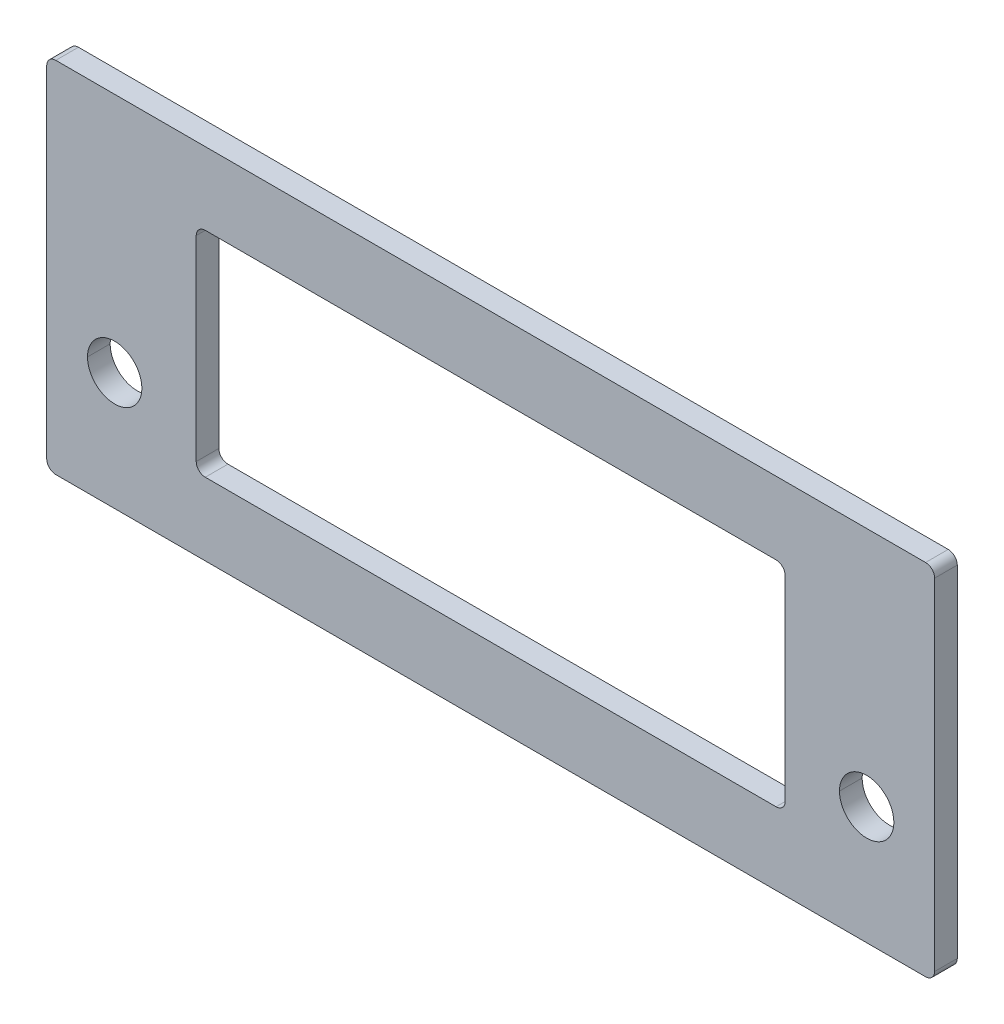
ISO-10303-21;
HEADER;
FILE_DESCRIPTION(('STEP AP214'),'2;1');
FILE_NAME('part.step','',(''),(''),'','','');
FILE_SCHEMA(('AUTOMOTIVE_DESIGN { 1 0 10303 214 1 1 1 1 }'));
ENDSEC;
DATA;
#1=APPLICATION_CONTEXT('core data for automotive mechanical design processes');
#2=APPLICATION_PROTOCOL_DEFINITION('international standard','automotive_design',2000,#1);
#3=PRODUCT_CONTEXT('',#1,'mechanical');
#4=PRODUCT('Part','Part','',(#3));
#5=PRODUCT_RELATED_PRODUCT_CATEGORY('part','',(#4));
#6=PRODUCT_DEFINITION_FORMATION('','',#4);
#7=PRODUCT_DEFINITION_CONTEXT('part definition',#1,'design');
#8=PRODUCT_DEFINITION('design','',#6,#7);
#9=PRODUCT_DEFINITION_SHAPE('','',#8);
#10=(LENGTH_UNIT() NAMED_UNIT(*) SI_UNIT(.MILLI.,.METRE.));
#11=(NAMED_UNIT(*) PLANE_ANGLE_UNIT() SI_UNIT($,.RADIAN.));
#12=(NAMED_UNIT(*) SI_UNIT($,.STERADIAN.) SOLID_ANGLE_UNIT());
#13=UNCERTAINTY_MEASURE_WITH_UNIT(LENGTH_MEASURE(1.E-05),#10,'distance_accuracy_value','');
#14=(GEOMETRIC_REPRESENTATION_CONTEXT(3) GLOBAL_UNCERTAINTY_ASSIGNED_CONTEXT((#13)) GLOBAL_UNIT_ASSIGNED_CONTEXT((#10,
#11,#12)) REPRESENTATION_CONTEXT('',''));
#15=CARTESIAN_POINT('',(0.,0.,0.));
#16=DIRECTION('',(0.,0.,1.));
#17=DIRECTION('',(1.,0.,0.));
#18=AXIS2_PLACEMENT_3D('',#15,#16,#17);
#19=CARTESIAN_POINT('',(48.,18.85,-8.5));
#20=DIRECTION('',(0.,0.,-1.));
#21=DIRECTION('',(-1.,0.,0.));
#22=AXIS2_PLACEMENT_3D('',#19,#20,#21);
#23=CYLINDRICAL_SURFACE('',#22,1.);
#24=CARTESIAN_POINT('',(48.,18.85,-8.5));
#25=DIRECTION('',(0.,0.,1.));
#26=DIRECTION('',(-1.,0.,0.));
#27=AXIS2_PLACEMENT_3D('',#24,#25,#26);
#28=CIRCLE('',#27,1.);
#29=CARTESIAN_POINT('',(49.,18.85,-8.5));
#30=VERTEX_POINT('',#29);
#31=CARTESIAN_POINT('',(48.,19.85,-8.5));
#32=VERTEX_POINT('',#31);
#33=EDGE_CURVE('E251',#30,#32,#28,.T.);
#34=ORIENTED_EDGE('',*,*,#33,.F.);
#35=DIRECTION('',(0.,0.,1.));
#36=VECTOR('',#35,1.);
#37=CARTESIAN_POINT('',(49.,18.85,-8.5));
#38=LINE('',#37,#36);
#39=CARTESIAN_POINT('',(49.,18.85,-11.));
#40=VERTEX_POINT('',#39);
#41=EDGE_CURVE('E398',#40,#30,#38,.T.);
#42=ORIENTED_EDGE('',*,*,#41,.F.);
#43=CARTESIAN_POINT('',(48.,18.85,-11.));
#44=DIRECTION('',(0.,0.,-1.));
#45=DIRECTION('',(-1.,0.,0.));
#46=AXIS2_PLACEMENT_3D('',#43,#44,#45);
#47=CIRCLE('',#46,1.);
#48=CARTESIAN_POINT('',(48.,19.85,-11.));
#49=VERTEX_POINT('',#48);
#50=EDGE_CURVE('E343',#49,#40,#47,.T.);
#51=ORIENTED_EDGE('',*,*,#50,.F.);
#52=DIRECTION('',(0.,0.,-1.));
#53=VECTOR('',#52,1.);
#54=CARTESIAN_POINT('',(48.,19.85,-8.5));
#55=LINE('',#54,#53);
#56=EDGE_CURVE('E404',#32,#49,#55,.T.);
#57=ORIENTED_EDGE('',*,*,#56,.F.);
#58=EDGE_LOOP('',(#34,#42,#51,#57));
#59=FACE_BOUND('',#58,.T.);
#60=ADVANCED_FACE('F15',(#59),#23,.T.);
#61=CARTESIAN_POINT('',(48.,-18.75,-8.5));
#62=DIRECTION('',(0.,0.,-1.));
#63=DIRECTION('',(-1.,0.,0.));
#64=AXIS2_PLACEMENT_3D('',#61,#62,#63);
#65=CYLINDRICAL_SURFACE('',#64,1.);
#66=CARTESIAN_POINT('',(48.,-18.75,-8.5));
#67=DIRECTION('',(0.,0.,1.));
#68=DIRECTION('',(-1.,0.,0.));
#69=AXIS2_PLACEMENT_3D('',#66,#67,#68);
#70=CIRCLE('',#69,1.);
#71=CARTESIAN_POINT('',(48.,-19.75,-8.5));
#72=VERTEX_POINT('',#71);
#73=CARTESIAN_POINT('',(49.,-18.75,-8.5));
#74=VERTEX_POINT('',#73);
#75=EDGE_CURVE('E227',#72,#74,#70,.T.);
#76=ORIENTED_EDGE('',*,*,#75,.F.);
#77=DIRECTION('',(0.,0.,1.));
#78=VECTOR('',#77,1.);
#79=CARTESIAN_POINT('',(48.,-19.75,-8.5));
#80=LINE('',#79,#78);
#81=CARTESIAN_POINT('',(48.,-19.75,-11.));
#82=VERTEX_POINT('',#81);
#83=EDGE_CURVE('E392',#82,#72,#80,.T.);
#84=ORIENTED_EDGE('',*,*,#83,.F.);
#85=CARTESIAN_POINT('',(48.,-18.75,-11.));
#86=DIRECTION('',(0.,0.,-1.));
#87=DIRECTION('',(-1.,0.,0.));
#88=AXIS2_PLACEMENT_3D('',#85,#86,#87);
#89=CIRCLE('',#88,1.);
#90=CARTESIAN_POINT('',(49.,-18.75,-11.));
#91=VERTEX_POINT('',#90);
#92=EDGE_CURVE('E240',#91,#82,#89,.T.);
#93=ORIENTED_EDGE('',*,*,#92,.F.);
#94=DIRECTION('',(0.,0.,-1.));
#95=VECTOR('',#94,1.);
#96=CARTESIAN_POINT('',(49.,-18.75,-8.5));
#97=LINE('',#96,#95);
#98=EDGE_CURVE('E395',#74,#91,#97,.T.);
#99=ORIENTED_EDGE('',*,*,#98,.F.);
#100=EDGE_LOOP('',(#76,#84,#93,#99));
#101=FACE_BOUND('',#100,.T.);
#102=ADVANCED_FACE('F465',(#101),#65,.T.);
#103=CARTESIAN_POINT('',(-48.,-18.75,-8.5));
#104=DIRECTION('',(0.,0.,-1.));
#105=DIRECTION('',(-1.,0.,0.));
#106=AXIS2_PLACEMENT_3D('',#103,#104,#105);
#107=CYLINDRICAL_SURFACE('',#106,1.);
#108=CARTESIAN_POINT('',(-48.,-18.75,-8.5));
#109=DIRECTION('',(0.,0.,1.));
#110=DIRECTION('',(-1.,0.,0.));
#111=AXIS2_PLACEMENT_3D('',#108,#109,#110);
#112=CIRCLE('',#111,1.);
#113=CARTESIAN_POINT('',(-49.,-18.75,-8.5));
#114=VERTEX_POINT('',#113);
#115=CARTESIAN_POINT('',(-48.,-19.75,-8.5));
#116=VERTEX_POINT('',#115);
#117=EDGE_CURVE('E228',#114,#116,#112,.T.);
#118=ORIENTED_EDGE('',*,*,#117,.F.);
#119=DIRECTION('',(0.,0.,1.));
#120=VECTOR('',#119,1.);
#121=CARTESIAN_POINT('',(-49.,-18.75,-8.5));
#122=LINE('',#121,#120);
#123=CARTESIAN_POINT('',(-49.,-18.75,-11.));
#124=VERTEX_POINT('',#123);
#125=EDGE_CURVE('E386',#124,#114,#122,.T.);
#126=ORIENTED_EDGE('',*,*,#125,.F.);
#127=CARTESIAN_POINT('',(-48.,-18.75,-11.));
#128=DIRECTION('',(0.,0.,-1.));
#129=DIRECTION('',(-1.,0.,0.));
#130=AXIS2_PLACEMENT_3D('',#127,#128,#129);
#131=CIRCLE('',#130,1.);
#132=CARTESIAN_POINT('',(-48.,-19.75,-11.));
#133=VERTEX_POINT('',#132);
#134=EDGE_CURVE('E293',#133,#124,#131,.T.);
#135=ORIENTED_EDGE('',*,*,#134,.F.);
#136=DIRECTION('',(0.,0.,-1.));
#137=VECTOR('',#136,1.);
#138=CARTESIAN_POINT('',(-48.,-19.75,-8.5));
#139=LINE('',#138,#137);
#140=EDGE_CURVE('E389',#116,#133,#139,.T.);
#141=ORIENTED_EDGE('',*,*,#140,.F.);
#142=EDGE_LOOP('',(#118,#126,#135,#141));
#143=FACE_BOUND('',#142,.T.);
#144=ADVANCED_FACE('F470',(#143),#107,.T.);
#145=CARTESIAN_POINT('',(-48.,18.85,-8.5));
#146=DIRECTION('',(0.,0.,-1.));
#147=DIRECTION('',(-1.,0.,0.));
#148=AXIS2_PLACEMENT_3D('',#145,#146,#147);
#149=CYLINDRICAL_SURFACE('',#148,1.);
#150=CARTESIAN_POINT('',(-48.,18.85,-8.5));
#151=DIRECTION('',(0.,0.,1.));
#152=DIRECTION('',(-1.,0.,0.));
#153=AXIS2_PLACEMENT_3D('',#150,#151,#152);
#154=CIRCLE('',#153,1.);
#155=CARTESIAN_POINT('',(-48.,19.85,-8.5));
#156=VERTEX_POINT('',#155);
#157=CARTESIAN_POINT('',(-49.,18.85,-8.5));
#158=VERTEX_POINT('',#157);
#159=EDGE_CURVE('E234',#156,#158,#154,.T.);
#160=ORIENTED_EDGE('',*,*,#159,.F.);
#161=DIRECTION('',(0.,0.,1.));
#162=VECTOR('',#161,1.);
#163=CARTESIAN_POINT('',(-48.,19.85,-8.5));
#164=LINE('',#163,#162);
#165=CARTESIAN_POINT('',(-48.,19.85,-11.));
#166=VERTEX_POINT('',#165);
#167=EDGE_CURVE('E401',#166,#156,#164,.T.);
#168=ORIENTED_EDGE('',*,*,#167,.F.);
#169=CARTESIAN_POINT('',(-48.,18.85,-11.));
#170=DIRECTION('',(0.,0.,-1.));
#171=DIRECTION('',(-1.,0.,0.));
#172=AXIS2_PLACEMENT_3D('',#169,#170,#171);
#173=CIRCLE('',#172,1.);
#174=CARTESIAN_POINT('',(-49.,18.85,-11.));
#175=VERTEX_POINT('',#174);
#176=EDGE_CURVE('E335',#175,#166,#173,.T.);
#177=ORIENTED_EDGE('',*,*,#176,.F.);
#178=DIRECTION('',(0.,0.,-1.));
#179=VECTOR('',#178,1.);
#180=CARTESIAN_POINT('',(-49.,18.85,-8.5));
#181=LINE('',#180,#179);
#182=EDGE_CURVE('E383',#158,#175,#181,.T.);
#183=ORIENTED_EDGE('',*,*,#182,.F.);
#184=EDGE_LOOP('',(#160,#168,#177,#183));
#185=FACE_BOUND('',#184,.T.);
#186=ADVANCED_FACE('F490',(#185),#149,.T.);
#187=CARTESIAN_POINT('',(-31.5,-10.75,60.6517172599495));
#188=DIRECTION('',(0.,0.,1.));
#189=DIRECTION('',(1.,0.,0.));
#190=AXIS2_PLACEMENT_3D('',#187,#188,#189);
#191=CYLINDRICAL_SURFACE('',#190,1.);
#192=CARTESIAN_POINT('',(-31.5,-10.75,-8.5));
#193=DIRECTION('',(0.,0.,-1.));
#194=DIRECTION('',(-1.,0.,0.));
#195=AXIS2_PLACEMENT_3D('',#192,#193,#194);
#196=CIRCLE('',#195,1.);
#197=CARTESIAN_POINT('',(-31.5,-11.75,-8.5));
#198=VERTEX_POINT('',#197);
#199=CARTESIAN_POINT('',(-32.5,-10.75,-8.5));
#200=VERTEX_POINT('',#199);
#201=EDGE_CURVE('E321',#198,#200,#196,.T.);
#202=ORIENTED_EDGE('',*,*,#201,.F.);
#203=DIRECTION('',(0.,0.,1.));
#204=VECTOR('',#203,1.);
#205=CARTESIAN_POINT('',(-31.5,-11.75,-8.5));
#206=LINE('',#205,#204);
#207=CARTESIAN_POINT('',(-31.5,-11.75,-11.));
#208=VERTEX_POINT('',#207);
#209=EDGE_CURVE('E329',#208,#198,#206,.T.);
#210=ORIENTED_EDGE('',*,*,#209,.F.);
#211=CARTESIAN_POINT('',(-31.5,-10.75,-11.));
#212=DIRECTION('',(0.,0.,1.));
#213=DIRECTION('',(-1.,0.,0.));
#214=AXIS2_PLACEMENT_3D('',#211,#212,#213);
#215=CIRCLE('',#214,1.);
#216=CARTESIAN_POINT('',(-32.5,-10.75,-11.));
#217=VERTEX_POINT('',#216);
#218=EDGE_CURVE('E377',#217,#208,#215,.T.);
#219=ORIENTED_EDGE('',*,*,#218,.F.);
#220=DIRECTION('',(0.,0.,-1.));
#221=VECTOR('',#220,1.);
#222=CARTESIAN_POINT('',(-32.5,-10.75,-11.));
#223=LINE('',#222,#221);
#224=EDGE_CURVE('E10',#200,#217,#223,.T.);
#225=ORIENTED_EDGE('',*,*,#224,.F.);
#226=EDGE_LOOP('',(#202,#210,#219,#225));
#227=FACE_BOUND('',#226,.T.);
#228=ADVANCED_FACE('F432',(#227),#191,.F.);
#229=CARTESIAN_POINT('',(-31.5,10.85,60.6517172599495));
#230=DIRECTION('',(0.,0.,1.));
#231=DIRECTION('',(1.,0.,0.));
#232=AXIS2_PLACEMENT_3D('',#229,#230,#231);
#233=CYLINDRICAL_SURFACE('',#232,1.);
#234=CARTESIAN_POINT('',(-31.5,10.85,-8.5));
#235=DIRECTION('',(0.,0.,-1.));
#236=DIRECTION('',(-1.,0.,0.));
#237=AXIS2_PLACEMENT_3D('',#234,#235,#236);
#238=CIRCLE('',#237,1.);
#239=CARTESIAN_POINT('',(-32.5,10.85,-8.5));
#240=VERTEX_POINT('',#239);
#241=CARTESIAN_POINT('',(-31.5,11.85,-8.5));
#242=VERTEX_POINT('',#241);
#243=EDGE_CURVE('E297',#240,#242,#238,.T.);
#244=ORIENTED_EDGE('',*,*,#243,.F.);
#245=DIRECTION('',(0.,0.,1.));
#246=VECTOR('',#245,1.);
#247=CARTESIAN_POINT('',(-32.5,10.85,-8.5));
#248=LINE('',#247,#246);
#249=CARTESIAN_POINT('',(-32.5,10.85,-11.));
#250=VERTEX_POINT('',#249);
#251=EDGE_CURVE('E18',#250,#240,#248,.T.);
#252=ORIENTED_EDGE('',*,*,#251,.F.);
#253=CARTESIAN_POINT('',(-31.5,10.85,-11.));
#254=DIRECTION('',(0.,0.,1.));
#255=DIRECTION('',(-1.,0.,0.));
#256=AXIS2_PLACEMENT_3D('',#253,#254,#255);
#257=CIRCLE('',#256,1.);
#258=CARTESIAN_POINT('',(-31.5,11.85,-11.));
#259=VERTEX_POINT('',#258);
#260=EDGE_CURVE('E273',#259,#250,#257,.T.);
#261=ORIENTED_EDGE('',*,*,#260,.F.);
#262=DIRECTION('',(0.,0.,-1.));
#263=VECTOR('',#262,1.);
#264=CARTESIAN_POINT('',(-31.5,11.85,-11.));
#265=LINE('',#264,#263);
#266=EDGE_CURVE('E410',#242,#259,#265,.T.);
#267=ORIENTED_EDGE('',*,*,#266,.F.);
#268=EDGE_LOOP('',(#244,#252,#261,#267));
#269=FACE_BOUND('',#268,.T.);
#270=ADVANCED_FACE('F427',(#269),#233,.F.);
#271=CARTESIAN_POINT('',(31.5,10.85,60.6517172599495));
#272=DIRECTION('',(0.,0.,1.));
#273=DIRECTION('',(1.,0.,0.));
#274=AXIS2_PLACEMENT_3D('',#271,#272,#273);
#275=CYLINDRICAL_SURFACE('',#274,1.);
#276=CARTESIAN_POINT('',(31.5,10.85,-8.5));
#277=DIRECTION('',(0.,0.,-1.));
#278=DIRECTION('',(-1.,0.,0.));
#279=AXIS2_PLACEMENT_3D('',#276,#277,#278);
#280=CIRCLE('',#279,1.);
#281=CARTESIAN_POINT('',(31.5,11.85,-8.5));
#282=VERTEX_POINT('',#281);
#283=CARTESIAN_POINT('',(32.5,10.85,-8.5));
#284=VERTEX_POINT('',#283);
#285=EDGE_CURVE('E305',#282,#284,#280,.T.);
#286=ORIENTED_EDGE('',*,*,#285,.F.);
#287=DIRECTION('',(0.,0.,1.));
#288=VECTOR('',#287,1.);
#289=CARTESIAN_POINT('',(31.5,11.85,-8.5));
#290=LINE('',#289,#288);
#291=CARTESIAN_POINT('',(31.5,11.85,-11.));
#292=VERTEX_POINT('',#291);
#293=EDGE_CURVE('E407',#292,#282,#290,.T.);
#294=ORIENTED_EDGE('',*,*,#293,.F.);
#295=CARTESIAN_POINT('',(31.5,10.85,-11.));
#296=DIRECTION('',(0.,0.,1.));
#297=DIRECTION('',(-1.,0.,0.));
#298=AXIS2_PLACEMENT_3D('',#295,#296,#297);
#299=CIRCLE('',#298,1.);
#300=CARTESIAN_POINT('',(32.5,10.85,-11.));
#301=VERTEX_POINT('',#300);
#302=EDGE_CURVE('E367',#301,#292,#299,.T.);
#303=ORIENTED_EDGE('',*,*,#302,.F.);
#304=DIRECTION('',(0.,0.,-1.));
#305=VECTOR('',#304,1.);
#306=CARTESIAN_POINT('',(32.5,10.85,-11.));
#307=LINE('',#306,#305);
#308=EDGE_CURVE('E330',#284,#301,#307,.T.);
#309=ORIENTED_EDGE('',*,*,#308,.F.);
#310=EDGE_LOOP('',(#286,#294,#303,#309));
#311=FACE_BOUND('',#310,.T.);
#312=ADVANCED_FACE('F443',(#311),#275,.F.);
#313=CARTESIAN_POINT('',(31.5,-10.75,60.6517172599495));
#314=DIRECTION('',(0.,0.,1.));
#315=DIRECTION('',(1.,0.,0.));
#316=AXIS2_PLACEMENT_3D('',#313,#314,#315);
#317=CYLINDRICAL_SURFACE('',#316,1.);
#318=CARTESIAN_POINT('',(31.5,-10.75,-8.5));
#319=DIRECTION('',(0.,0.,-1.));
#320=DIRECTION('',(-1.,0.,0.));
#321=AXIS2_PLACEMENT_3D('',#318,#319,#320);
#322=CIRCLE('',#321,1.);
#323=CARTESIAN_POINT('',(32.5,-10.75,-8.5));
#324=VERTEX_POINT('',#323);
#325=CARTESIAN_POINT('',(31.5,-11.75,-8.5));
#326=VERTEX_POINT('',#325);
#327=EDGE_CURVE('E313',#324,#326,#322,.T.);
#328=ORIENTED_EDGE('',*,*,#327,.F.);
#329=DIRECTION('',(0.,0.,1.));
#330=VECTOR('',#329,1.);
#331=CARTESIAN_POINT('',(32.5,-10.75,-8.5));
#332=LINE('',#331,#330);
#333=CARTESIAN_POINT('',(32.5,-10.75,-11.));
#334=VERTEX_POINT('',#333);
#335=EDGE_CURVE('E413',#334,#324,#332,.T.);
#336=ORIENTED_EDGE('',*,*,#335,.F.);
#337=CARTESIAN_POINT('',(31.5,-10.75,-11.));
#338=DIRECTION('',(0.,0.,1.));
#339=DIRECTION('',(-1.,0.,0.));
#340=AXIS2_PLACEMENT_3D('',#337,#338,#339);
#341=CIRCLE('',#340,1.);
#342=CARTESIAN_POINT('',(31.5,-11.75,-11.));
#343=VERTEX_POINT('',#342);
#344=EDGE_CURVE('E359',#343,#334,#341,.T.);
#345=ORIENTED_EDGE('',*,*,#344,.F.);
#346=DIRECTION('',(0.,0.,-1.));
#347=VECTOR('',#346,1.);
#348=CARTESIAN_POINT('',(31.5,-11.75,-11.));
#349=LINE('',#348,#347);
#350=EDGE_CURVE('E327',#326,#343,#349,.T.);
#351=ORIENTED_EDGE('',*,*,#350,.F.);
#352=EDGE_LOOP('',(#328,#336,#345,#351));
#353=FACE_BOUND('',#352,.T.);
#354=ADVANCED_FACE('F450',(#353),#317,.F.);
#355=CARTESIAN_POINT('',(41.5,-6.75,60.6517172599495));
#356=DIRECTION('',(0.,0.,-1.));
#357=DIRECTION('',(-1.,0.,0.));
#358=AXIS2_PLACEMENT_3D('',#355,#356,#357);
#359=CYLINDRICAL_SURFACE('',#358,3.);
#360=DIRECTION('',(0.,0.,-1.));
#361=VECTOR('',#360,1.);
#362=CARTESIAN_POINT('',(44.5,-6.75,60.6517172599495));
#363=LINE('',#362,#361);
#364=CARTESIAN_POINT('',(44.5,-6.75,-8.5));
#365=VERTEX_POINT('',#364);
#366=CARTESIAN_POINT('',(44.5,-6.75,-11.));
#367=VERTEX_POINT('',#366);
#368=EDGE_CURVE('E209',#365,#367,#363,.T.);
#369=ORIENTED_EDGE('',*,*,#368,.F.);
#370=CARTESIAN_POINT('',(41.5,-6.75,-8.5));
#371=DIRECTION('',(0.,0.,-1.));
#372=DIRECTION('',(-1.,0.,0.));
#373=AXIS2_PLACEMENT_3D('',#370,#371,#372);
#374=CIRCLE('',#373,3.);
#375=CARTESIAN_POINT('',(38.5,-6.75,-8.5));
#376=VERTEX_POINT('',#375);
#377=EDGE_CURVE('E195',#376,#365,#374,.T.);
#378=ORIENTED_EDGE('',*,*,#377,.F.);
#379=DIRECTION('',(0.,0.,-1.));
#380=VECTOR('',#379,1.);
#381=CARTESIAN_POINT('',(38.5,-6.75,60.6517172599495));
#382=LINE('',#381,#380);
#383=CARTESIAN_POINT('',(38.5,-6.75,-11.));
#384=VERTEX_POINT('',#383);
#385=EDGE_CURVE('E219',#376,#384,#382,.T.);
#386=ORIENTED_EDGE('',*,*,#385,.T.);
#387=CARTESIAN_POINT('',(41.5,-6.75,-11.));
#388=DIRECTION('',(0.,0.,1.));
#389=DIRECTION('',(1.,0.,0.));
#390=AXIS2_PLACEMENT_3D('',#387,#388,#389);
#391=CIRCLE('',#390,3.);
#392=EDGE_CURVE('E211',#367,#384,#391,.T.);
#393=ORIENTED_EDGE('',*,*,#392,.F.);
#394=EDGE_LOOP('',(#369,#378,#386,#393));
#395=FACE_BOUND('',#394,.T.);
#396=ADVANCED_FACE('F210',(#395),#359,.F.);
#397=CARTESIAN_POINT('',(-41.5,-6.75,60.6517172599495));
#398=DIRECTION('',(0.,0.,-1.));
#399=DIRECTION('',(-1.,0.,0.));
#400=AXIS2_PLACEMENT_3D('',#397,#398,#399);
#401=CYLINDRICAL_SURFACE('',#400,3.);
#402=DIRECTION('',(0.,0.,-1.));
#403=VECTOR('',#402,1.);
#404=CARTESIAN_POINT('',(-38.5,-6.75,60.6517172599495));
#405=LINE('',#404,#403);
#406=CARTESIAN_POINT('',(-38.5,-6.75,-8.5));
#407=VERTEX_POINT('',#406);
#408=CARTESIAN_POINT('',(-38.5,-6.75,-11.));
#409=VERTEX_POINT('',#408);
#410=EDGE_CURVE('E261',#407,#409,#405,.T.);
#411=ORIENTED_EDGE('',*,*,#410,.F.);
#412=CARTESIAN_POINT('',(-41.5,-6.75,-8.5));
#413=DIRECTION('',(0.,0.,-1.));
#414=DIRECTION('',(-1.,0.,0.));
#415=AXIS2_PLACEMENT_3D('',#412,#413,#414);
#416=CIRCLE('',#415,3.);
#417=CARTESIAN_POINT('',(-44.5,-6.75,-8.5));
#418=VERTEX_POINT('',#417);
#419=EDGE_CURVE('E206',#418,#407,#416,.T.);
#420=ORIENTED_EDGE('',*,*,#419,.F.);
#421=DIRECTION('',(0.,0.,-1.));
#422=VECTOR('',#421,1.);
#423=CARTESIAN_POINT('',(-44.5,-6.75,60.6517172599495));
#424=LINE('',#423,#422);
#425=CARTESIAN_POINT('',(-44.5,-6.75,-11.));
#426=VERTEX_POINT('',#425);
#427=EDGE_CURVE('E269',#418,#426,#424,.T.);
#428=ORIENTED_EDGE('',*,*,#427,.T.);
#429=CARTESIAN_POINT('',(-41.5,-6.75,-11.));
#430=DIRECTION('',(0.,0.,1.));
#431=DIRECTION('',(1.,0.,0.));
#432=AXIS2_PLACEMENT_3D('',#429,#430,#431);
#433=CIRCLE('',#432,3.);
#434=EDGE_CURVE('E289',#409,#426,#433,.T.);
#435=ORIENTED_EDGE('',*,*,#434,.F.);
#436=EDGE_LOOP('',(#411,#420,#428,#435));
#437=FACE_BOUND('',#436,.T.);
#438=ADVANCED_FACE('F460',(#437),#401,.F.);
#439=CARTESIAN_POINT('',(-32.5,-11.75,60.6517172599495));
#440=DIRECTION('',(1.,0.,0.));
#441=DIRECTION('',(0.,1.,0.));
#442=AXIS2_PLACEMENT_3D('',#439,#440,#441);
#443=PLANE('',#442);
#444=DIRECTION('',(0.,-1.,0.));
#445=VECTOR('',#444,1.);
#446=CARTESIAN_POINT('',(-32.5,-11.75,-11.));
#447=LINE('',#446,#445);
#448=EDGE_CURVE('E277',#250,#217,#447,.T.);
#449=ORIENTED_EDGE('',*,*,#448,.F.);
#450=ORIENTED_EDGE('',*,*,#251,.T.);
#451=DIRECTION('',(0.,1.,0.));
#452=VECTOR('',#451,1.);
#453=CARTESIAN_POINT('',(-32.5,-11.75,-8.5));
#454=LINE('',#453,#452);
#455=EDGE_CURVE('E285',#200,#240,#454,.T.);
#456=ORIENTED_EDGE('',*,*,#455,.F.);
#457=ORIENTED_EDGE('',*,*,#224,.T.);
#458=EDGE_LOOP('',(#449,#450,#456,#457));
#459=FACE_BOUND('',#458,.T.);
#460=ADVANCED_FACE('F426',(#459),#443,.T.);
#461=CARTESIAN_POINT('',(-32.5,-11.75,60.6517172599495));
#462=DIRECTION('',(0.,1.,0.));
#463=DIRECTION('',(1.,0.,0.));
#464=AXIS2_PLACEMENT_3D('',#461,#462,#463);
#465=PLANE('',#464);
#466=DIRECTION('',(-1.,0.,0.));
#467=VECTOR('',#466,1.);
#468=CARTESIAN_POINT('',(-32.5,-11.75,-8.5));
#469=LINE('',#468,#467);
#470=EDGE_CURVE('E317',#326,#198,#469,.T.);
#471=ORIENTED_EDGE('',*,*,#470,.F.);
#472=ORIENTED_EDGE('',*,*,#350,.T.);
#473=DIRECTION('',(1.,0.,0.));
#474=VECTOR('',#473,1.);
#475=CARTESIAN_POINT('',(-32.5,-11.75,-11.));
#476=LINE('',#475,#474);
#477=EDGE_CURVE('E292',#208,#343,#476,.T.);
#478=ORIENTED_EDGE('',*,*,#477,.F.);
#479=ORIENTED_EDGE('',*,*,#209,.T.);
#480=EDGE_LOOP('',(#471,#472,#478,#479));
#481=FACE_BOUND('',#480,.T.);
#482=ADVANCED_FACE('F451',(#481),#465,.T.);
#483=CARTESIAN_POINT('',(32.5,-11.75,60.6517172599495));
#484=DIRECTION('',(-1.,0.,0.));
#485=DIRECTION('',(0.,0.,1.));
#486=AXIS2_PLACEMENT_3D('',#483,#484,#485);
#487=PLANE('',#486);
#488=DIRECTION('',(0.,1.,0.));
#489=VECTOR('',#488,1.);
#490=CARTESIAN_POINT('',(32.5,-11.75,-11.));
#491=LINE('',#490,#489);
#492=EDGE_CURVE('E363',#334,#301,#491,.T.);
#493=ORIENTED_EDGE('',*,*,#492,.F.);
#494=ORIENTED_EDGE('',*,*,#335,.T.);
#495=DIRECTION('',(0.,-1.,0.));
#496=VECTOR('',#495,1.);
#497=CARTESIAN_POINT('',(32.5,-11.75,-8.5));
#498=LINE('',#497,#496);
#499=EDGE_CURVE('E309',#284,#324,#498,.T.);
#500=ORIENTED_EDGE('',*,*,#499,.F.);
#501=ORIENTED_EDGE('',*,*,#308,.T.);
#502=EDGE_LOOP('',(#493,#494,#500,#501));
#503=FACE_BOUND('',#502,.T.);
#504=ADVANCED_FACE('F446',(#503),#487,.T.);
#505=CARTESIAN_POINT('',(-32.5,11.85,60.6517172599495));
#506=DIRECTION('',(0.,-1.,0.));
#507=DIRECTION('',(0.,0.,-1.));
#508=AXIS2_PLACEMENT_3D('',#505,#506,#507);
#509=PLANE('',#508);
#510=DIRECTION('',(-1.,0.,0.));
#511=VECTOR('',#510,1.);
#512=CARTESIAN_POINT('',(-32.5,11.85,-11.));
#513=LINE('',#512,#511);
#514=EDGE_CURVE('E278',#292,#259,#513,.T.);
#515=ORIENTED_EDGE('',*,*,#514,.F.);
#516=ORIENTED_EDGE('',*,*,#293,.T.);
#517=DIRECTION('',(1.,0.,0.));
#518=VECTOR('',#517,1.);
#519=CARTESIAN_POINT('',(-32.5,11.85,-8.5));
#520=LINE('',#519,#518);
#521=EDGE_CURVE('E301',#242,#282,#520,.T.);
#522=ORIENTED_EDGE('',*,*,#521,.F.);
#523=ORIENTED_EDGE('',*,*,#266,.T.);
#524=EDGE_LOOP('',(#515,#516,#522,#523));
#525=FACE_BOUND('',#524,.T.);
#526=ADVANCED_FACE('F439',(#525),#509,.T.);
#527=CARTESIAN_POINT('',(-49.,19.85,-8.5));
#528=DIRECTION('',(0.,-1.,0.));
#529=DIRECTION('',(0.,0.,-1.));
#530=AXIS2_PLACEMENT_3D('',#527,#528,#529);
#531=PLANE('',#530);
#532=DIRECTION('',(-1.,0.,0.));
#533=VECTOR('',#532,1.);
#534=CARTESIAN_POINT('',(-49.,19.85,-11.));
#535=LINE('',#534,#533);
#536=EDGE_CURVE('E339',#49,#166,#535,.T.);
#537=ORIENTED_EDGE('',*,*,#536,.T.);
#538=ORIENTED_EDGE('',*,*,#167,.T.);
#539=DIRECTION('',(-1.,0.,0.));
#540=VECTOR('',#539,1.);
#541=CARTESIAN_POINT('',(-49.,19.85,-8.5));
#542=LINE('',#541,#540);
#543=EDGE_CURVE('E239',#32,#156,#542,.T.);
#544=ORIENTED_EDGE('',*,*,#543,.F.);
#545=ORIENTED_EDGE('',*,*,#56,.T.);
#546=EDGE_LOOP('',(#537,#538,#544,#545));
#547=FACE_BOUND('',#546,.T.);
#548=ADVANCED_FACE('F486',(#547),#531,.F.);
#549=CARTESIAN_POINT('',(49.,-19.75,-8.5));
#550=DIRECTION('',(-1.,0.,0.));
#551=DIRECTION('',(0.,0.,1.));
#552=AXIS2_PLACEMENT_3D('',#549,#550,#551);
#553=PLANE('',#552);
#554=DIRECTION('',(0.,1.,0.));
#555=VECTOR('',#554,1.);
#556=CARTESIAN_POINT('',(49.,-19.75,-8.5));
#557=LINE('',#556,#555);
#558=EDGE_CURVE('E233',#74,#30,#557,.T.);
#559=ORIENTED_EDGE('',*,*,#558,.F.);
#560=ORIENTED_EDGE('',*,*,#98,.T.);
#561=DIRECTION('',(0.,1.,0.));
#562=VECTOR('',#561,1.);
#563=CARTESIAN_POINT('',(49.,-19.75,-11.));
#564=LINE('',#563,#562);
#565=EDGE_CURVE('E245',#91,#40,#564,.T.);
#566=ORIENTED_EDGE('',*,*,#565,.T.);
#567=ORIENTED_EDGE('',*,*,#41,.T.);
#568=EDGE_LOOP('',(#559,#560,#566,#567));
#569=FACE_BOUND('',#568,.T.);
#570=ADVANCED_FACE('F478',(#569),#553,.F.);
#571=CARTESIAN_POINT('',(-49.,-19.75,-8.5));
#572=DIRECTION('',(0.,1.,0.));
#573=DIRECTION('',(1.,0.,0.));
#574=AXIS2_PLACEMENT_3D('',#571,#572,#573);
#575=PLANE('',#574);
#576=DIRECTION('',(1.,0.,0.));
#577=VECTOR('',#576,1.);
#578=CARTESIAN_POINT('',(-49.,-19.75,-8.5));
#579=LINE('',#578,#577);
#580=EDGE_CURVE('E225',#116,#72,#579,.T.);
#581=ORIENTED_EDGE('',*,*,#580,.F.);
#582=ORIENTED_EDGE('',*,*,#140,.T.);
#583=DIRECTION('',(1.,0.,0.));
#584=VECTOR('',#583,1.);
#585=CARTESIAN_POINT('',(-49.,-19.75,-11.));
#586=LINE('',#585,#584);
#587=EDGE_CURVE('E244',#133,#82,#586,.T.);
#588=ORIENTED_EDGE('',*,*,#587,.T.);
#589=ORIENTED_EDGE('',*,*,#83,.T.);
#590=EDGE_LOOP('',(#581,#582,#588,#589));
#591=FACE_BOUND('',#590,.T.);
#592=ADVANCED_FACE('F498',(#591),#575,.F.);
#593=CARTESIAN_POINT('',(-49.,-19.75,-8.5));
#594=DIRECTION('',(1.,0.,0.));
#595=DIRECTION('',(0.,1.,0.));
#596=AXIS2_PLACEMENT_3D('',#593,#594,#595);
#597=PLANE('',#596);
#598=DIRECTION('',(0.,-1.,0.));
#599=VECTOR('',#598,1.);
#600=CARTESIAN_POINT('',(-49.,-19.75,-8.5));
#601=LINE('',#600,#599);
#602=EDGE_CURVE('E238',#158,#114,#601,.T.);
#603=ORIENTED_EDGE('',*,*,#602,.F.);
#604=ORIENTED_EDGE('',*,*,#182,.T.);
#605=DIRECTION('',(0.,-1.,0.));
#606=VECTOR('',#605,1.);
#607=CARTESIAN_POINT('',(-49.,-19.75,-11.));
#608=LINE('',#607,#606);
#609=EDGE_CURVE('E205',#175,#124,#608,.T.);
#610=ORIENTED_EDGE('',*,*,#609,.T.);
#611=ORIENTED_EDGE('',*,*,#125,.T.);
#612=EDGE_LOOP('',(#603,#604,#610,#611));
#613=FACE_BOUND('',#612,.T.);
#614=ADVANCED_FACE('F492',(#613),#597,.F.);
#615=CARTESIAN_POINT('',(-49.,19.85,-11.));
#616=DIRECTION('',(0.,0.,-1.));
#617=DIRECTION('',(0.,-1.,0.));
#618=AXIS2_PLACEMENT_3D('',#615,#616,#617);
#619=PLANE('',#618);
#620=CARTESIAN_POINT('',(41.5,-6.75,-11.));
#621=DIRECTION('',(0.,0.,1.));
#622=DIRECTION('',(1.,0.,0.));
#623=AXIS2_PLACEMENT_3D('',#620,#621,#622);
#624=CIRCLE('',#623,3.);
#625=EDGE_CURVE('E216',#384,#367,#624,.T.);
#626=ORIENTED_EDGE('',*,*,#625,.T.);
#627=ORIENTED_EDGE('',*,*,#392,.T.);
#628=EDGE_LOOP('',(#626,#627));
#629=FACE_BOUND('',#628,.T.);
#630=ORIENTED_EDGE('',*,*,#477,.T.);
#631=ORIENTED_EDGE('',*,*,#344,.T.);
#632=ORIENTED_EDGE('',*,*,#492,.T.);
#633=ORIENTED_EDGE('',*,*,#302,.T.);
#634=ORIENTED_EDGE('',*,*,#514,.T.);
#635=ORIENTED_EDGE('',*,*,#260,.T.);
#636=ORIENTED_EDGE('',*,*,#448,.T.);
#637=ORIENTED_EDGE('',*,*,#218,.T.);
#638=EDGE_LOOP('',(#630,#631,#632,#633,#634,#635,#636,#637));
#639=FACE_BOUND('',#638,.T.);
#640=CARTESIAN_POINT('',(-41.5,-6.75,-11.));
#641=DIRECTION('',(0.,0.,1.));
#642=DIRECTION('',(1.,0.,0.));
#643=AXIS2_PLACEMENT_3D('',#640,#641,#642);
#644=CIRCLE('',#643,3.);
#645=EDGE_CURVE('E265',#426,#409,#644,.T.);
#646=ORIENTED_EDGE('',*,*,#645,.T.);
#647=ORIENTED_EDGE('',*,*,#434,.T.);
#648=EDGE_LOOP('',(#646,#647));
#649=FACE_BOUND('',#648,.T.);
#650=ORIENTED_EDGE('',*,*,#609,.F.);
#651=ORIENTED_EDGE('',*,*,#176,.T.);
#652=ORIENTED_EDGE('',*,*,#536,.F.);
#653=ORIENTED_EDGE('',*,*,#50,.T.);
#654=ORIENTED_EDGE('',*,*,#565,.F.);
#655=ORIENTED_EDGE('',*,*,#92,.T.);
#656=ORIENTED_EDGE('',*,*,#587,.F.);
#657=ORIENTED_EDGE('',*,*,#134,.T.);
#658=EDGE_LOOP('',(#650,#651,#652,#653,#654,#655,#656,#657));
#659=FACE_BOUND('',#658,.T.);
#660=ADVANCED_FACE('F434',(#629,#639,#649,#659),#619,.T.);
#661=CARTESIAN_POINT('',(-49.,19.85,-8.5));
#662=DIRECTION('',(0.,0.,-1.));
#663=DIRECTION('',(0.,-1.,0.));
#664=AXIS2_PLACEMENT_3D('',#661,#662,#663);
#665=PLANE('',#664);
#666=ORIENTED_EDGE('',*,*,#377,.T.);
#667=CARTESIAN_POINT('',(41.5,-6.75,-8.5));
#668=DIRECTION('',(0.,0.,-1.));
#669=DIRECTION('',(-1.,0.,0.));
#670=AXIS2_PLACEMENT_3D('',#667,#668,#669);
#671=CIRCLE('',#670,3.);
#672=EDGE_CURVE('E200',#365,#376,#671,.T.);
#673=ORIENTED_EDGE('',*,*,#672,.T.);
#674=EDGE_LOOP('',(#666,#673));
#675=FACE_BOUND('',#674,.T.);
#676=ORIENTED_EDGE('',*,*,#419,.T.);
#677=CARTESIAN_POINT('',(-41.5,-6.75,-8.5));
#678=DIRECTION('',(0.,0.,-1.));
#679=DIRECTION('',(-1.,0.,0.));
#680=AXIS2_PLACEMENT_3D('',#677,#678,#679);
#681=CIRCLE('',#680,3.);
#682=EDGE_CURVE('E257',#407,#418,#681,.T.);
#683=ORIENTED_EDGE('',*,*,#682,.T.);
#684=EDGE_LOOP('',(#676,#683));
#685=FACE_BOUND('',#684,.T.);
#686=ORIENTED_EDGE('',*,*,#455,.T.);
#687=ORIENTED_EDGE('',*,*,#243,.T.);
#688=ORIENTED_EDGE('',*,*,#521,.T.);
#689=ORIENTED_EDGE('',*,*,#285,.T.);
#690=ORIENTED_EDGE('',*,*,#499,.T.);
#691=ORIENTED_EDGE('',*,*,#327,.T.);
#692=ORIENTED_EDGE('',*,*,#470,.T.);
#693=ORIENTED_EDGE('',*,*,#201,.T.);
#694=EDGE_LOOP('',(#686,#687,#688,#689,#690,#691,#692,#693));
#695=FACE_BOUND('',#694,.T.);
#696=ORIENTED_EDGE('',*,*,#543,.T.);
#697=ORIENTED_EDGE('',*,*,#159,.T.);
#698=ORIENTED_EDGE('',*,*,#602,.T.);
#699=ORIENTED_EDGE('',*,*,#117,.T.);
#700=ORIENTED_EDGE('',*,*,#580,.T.);
#701=ORIENTED_EDGE('',*,*,#75,.T.);
#702=ORIENTED_EDGE('',*,*,#558,.T.);
#703=ORIENTED_EDGE('',*,*,#33,.T.);
#704=EDGE_LOOP('',(#696,#697,#698,#699,#700,#701,#702,#703));
#705=FACE_BOUND('',#704,.T.);
#706=ADVANCED_FACE('F197',(#675,#685,#695,#705),#665,.F.);
#707=CARTESIAN_POINT('',(-41.5,-6.75,60.6517172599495));
#708=DIRECTION('',(0.,0.,-1.));
#709=DIRECTION('',(-1.,0.,0.));
#710=AXIS2_PLACEMENT_3D('',#707,#708,#709);
#711=CYLINDRICAL_SURFACE('',#710,3.);
#712=ORIENTED_EDGE('',*,*,#682,.F.);
#713=ORIENTED_EDGE('',*,*,#410,.T.);
#714=ORIENTED_EDGE('',*,*,#645,.F.);
#715=ORIENTED_EDGE('',*,*,#427,.F.);
#716=EDGE_LOOP('',(#712,#713,#714,#715));
#717=FACE_BOUND('',#716,.T.);
#718=ADVANCED_FACE('F633',(#717),#711,.F.);
#719=CARTESIAN_POINT('',(41.5,-6.75,60.6517172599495));
#720=DIRECTION('',(0.,0.,-1.));
#721=DIRECTION('',(-1.,0.,0.));
#722=AXIS2_PLACEMENT_3D('',#719,#720,#721);
#723=CYLINDRICAL_SURFACE('',#722,3.);
#724=ORIENTED_EDGE('',*,*,#672,.F.);
#725=ORIENTED_EDGE('',*,*,#368,.T.);
#726=ORIENTED_EDGE('',*,*,#625,.F.);
#727=ORIENTED_EDGE('',*,*,#385,.F.);
#728=EDGE_LOOP('',(#724,#725,#726,#727));
#729=FACE_BOUND('',#728,.T.);
#730=ADVANCED_FACE('F218',(#729),#723,.F.);
#731=CLOSED_SHELL('',(#60,#102,#144,#186,#228,#270,#312,#354,#396,#438,#460,#482,#504,#526,#548,
#570,#592,#614,#660,#706,#718,#730));
#732=MANIFOLD_SOLID_BREP('B1',#731);
#733=ADVANCED_BREP_SHAPE_REPRESENTATION('',(#18,#732),#14);
#734=SHAPE_DEFINITION_REPRESENTATION(#9,#733);
ENDSEC;
END-ISO-10303-21;
